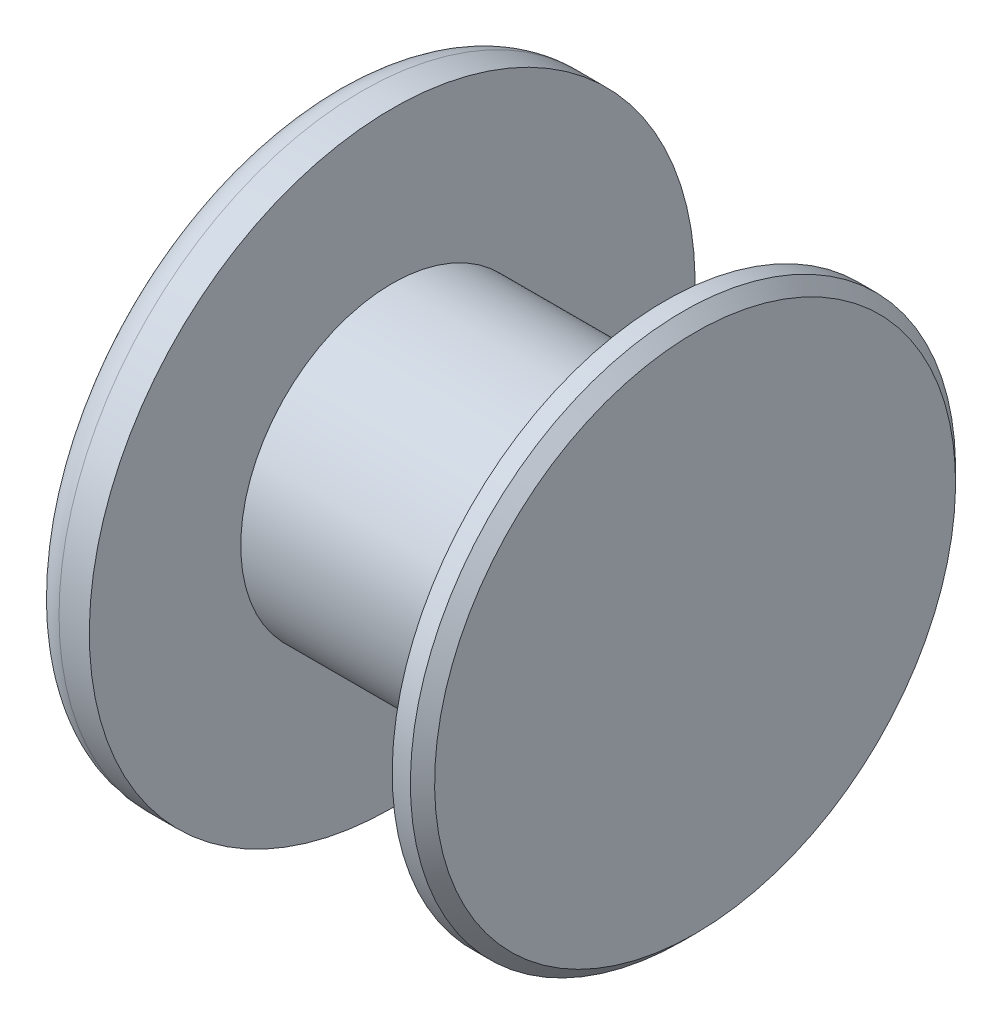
from build123d import *

# Parameters (mm, degrees)
CONG_1_R        = 0.5
CHANFREIN1_SIZE = 0.2


with BuildPart() as part:
    # Esquisse1 → R_volution1 (revolve)
    with BuildSketch(Plane.XY, mode=Mode.PRIVATE) as r_volution1_sk:
        Polygon((-3, 0), (-3, 5), (-2, 5), (-2, 2.5), (2.5, 2.5), (2.5, 4.5), (3, 4.5), (3, 0), align=None)
    revolve(r_volution1_sk.sketch.rotate(Axis((-3, 0, 0), (1, 0, 0)), 180), axis=Axis((-3, 0, 0), (1, 0, 0)))

    # Cong_1
    cong_1_edges = [part.edges().sort_by_distance(p)[0] for p in [
        (-3, 5, 0),
    ]]
    fillet(cong_1_edges, radius=CONG_1_R)

    # Chanfrein1
    chanfrein1_edges = [part.edges().sort_by_distance(p)[0] for p in [
        (3, 4.5, 0),
    ]]
    chamfer(chanfrein1_edges, length=CHANFREIN1_SIZE)


solid = part.part
